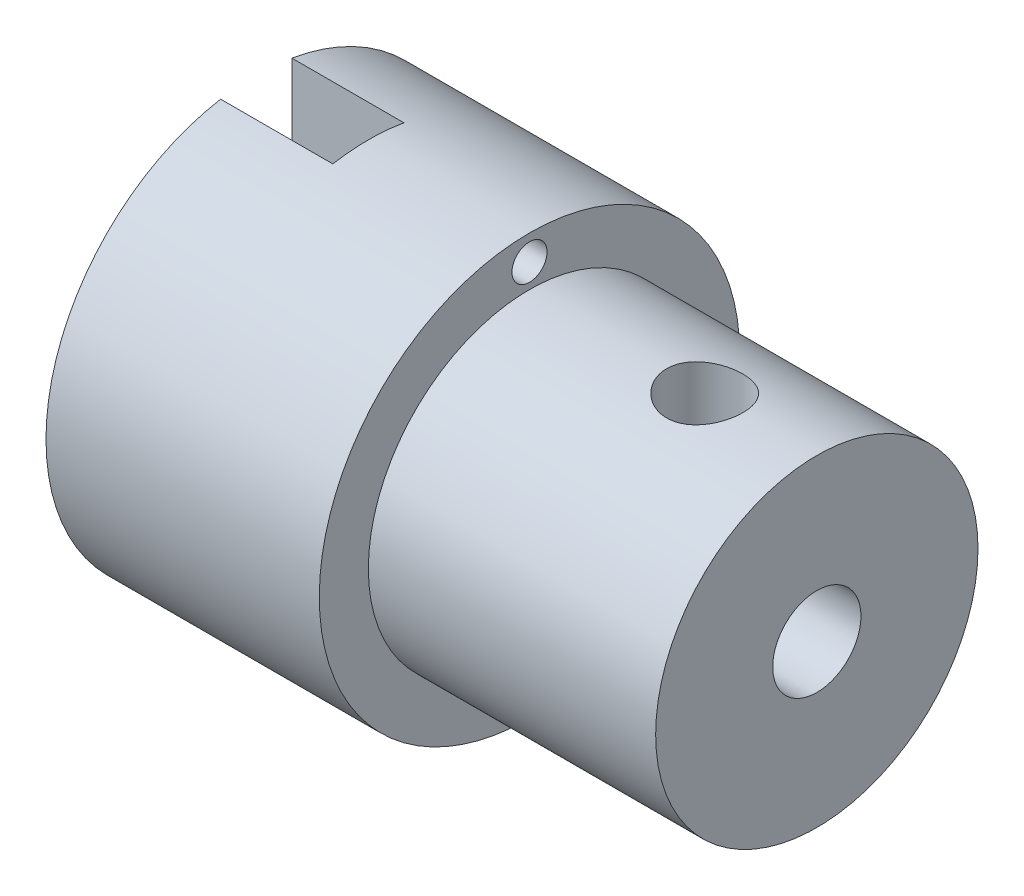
ISO-10303-21;
HEADER;
FILE_DESCRIPTION(('STEP AP214'),'2;1');
FILE_NAME('part.step','',(''),(''),'','','');
FILE_SCHEMA(('AUTOMOTIVE_DESIGN { 1 0 10303 214 1 1 1 1 }'));
ENDSEC;
DATA;
#1=APPLICATION_CONTEXT('core data for automotive mechanical design processes');
#2=APPLICATION_PROTOCOL_DEFINITION('international standard','automotive_design',2000,#1);
#3=PRODUCT_CONTEXT('',#1,'mechanical');
#4=PRODUCT('Part','Part','',(#3));
#5=PRODUCT_RELATED_PRODUCT_CATEGORY('part','',(#4));
#6=PRODUCT_DEFINITION_FORMATION('','',#4);
#7=PRODUCT_DEFINITION_CONTEXT('part definition',#1,'design');
#8=PRODUCT_DEFINITION('design','',#6,#7);
#9=PRODUCT_DEFINITION_SHAPE('','',#8);
#10=(LENGTH_UNIT() NAMED_UNIT(*) SI_UNIT(.MILLI.,.METRE.));
#11=(NAMED_UNIT(*) PLANE_ANGLE_UNIT() SI_UNIT($,.RADIAN.));
#12=(NAMED_UNIT(*) SI_UNIT($,.STERADIAN.) SOLID_ANGLE_UNIT());
#13=UNCERTAINTY_MEASURE_WITH_UNIT(LENGTH_MEASURE(1.E-05),#10,'distance_accuracy_value','');
#14=(GEOMETRIC_REPRESENTATION_CONTEXT(3) GLOBAL_UNCERTAINTY_ASSIGNED_CONTEXT((#13)) GLOBAL_UNIT_ASSIGNED_CONTEXT((#10,
#11,#12)) REPRESENTATION_CONTEXT('',''));
#15=CARTESIAN_POINT('',(0.,0.,0.));
#16=DIRECTION('',(0.,0.,1.));
#17=DIRECTION('',(1.,0.,0.));
#18=AXIS2_PLACEMENT_3D('',#15,#16,#17);
#19=CARTESIAN_POINT('',(25.4,0.,0.));
#20=DIRECTION('',(-1.,0.,0.));
#21=DIRECTION('',(0.,0.,1.));
#22=AXIS2_PLACEMENT_3D('',#19,#20,#21);
#23=CYLINDRICAL_SURFACE('',#22,1.5875);
#24=CARTESIAN_POINT('',(9.50799934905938,0.,0.));
#25=DIRECTION('',(-1.,0.,0.));
#26=DIRECTION('',(0.,0.,1.));
#27=AXIS2_PLACEMENT_3D('',#24,#25,#26);
#28=CIRCLE('',#27,1.5875);
#29=CARTESIAN_POINT('',(9.50799934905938,0.,1.5875));
#30=VERTEX_POINT('',#29);
#31=EDGE_CURVE('E137',#30,#30,#28,.F.);
#32=ORIENTED_EDGE('',*,*,#31,.F.);
#33=EDGE_LOOP('',(#32));
#34=FACE_BOUND('',#33,.T.);
#35=CARTESIAN_POINT('',(15.24,0.,0.));
#36=DIRECTION('',(1.,0.,0.));
#37=DIRECTION('',(0.,0.,-1.));
#38=AXIS2_PLACEMENT_3D('',#35,#36,#37);
#39=CIRCLE('',#38,1.5875);
#40=CARTESIAN_POINT('',(15.24,0.,-1.5875));
#41=VERTEX_POINT('',#40);
#42=EDGE_CURVE('E54',#41,#41,#39,.T.);
#43=ORIENTED_EDGE('',*,*,#42,.T.);
#44=EDGE_LOOP('',(#43));
#45=FACE_BOUND('',#44,.T.);
#46=ADVANCED_FACE('F50',(#34,#45),#23,.F.);
#47=CARTESIAN_POINT('',(5.08,-10.16,1.6129));
#48=DIRECTION('',(0.,0.,1.));
#49=DIRECTION('',(1.,0.,0.));
#50=AXIS2_PLACEMENT_3D('',#47,#48,#49);
#51=PLANE('',#50);
#52=DIRECTION('',(0.,1.,0.));
#53=VECTOR('',#52,1.);
#54=CARTESIAN_POINT('',(5.08,-10.16,1.6129));
#55=LINE('',#54,#53);
#56=CARTESIAN_POINT('',(5.08,3.62622808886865,1.6129));
#57=VERTEX_POINT('',#56);
#58=CARTESIAN_POINT('',(5.08,9.38744792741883,1.6129));
#59=VERTEX_POINT('',#58);
#60=EDGE_CURVE('E136',#57,#59,#55,.T.);
#61=ORIENTED_EDGE('',*,*,#60,.F.);
#62=DIRECTION('',(-1.,0.,0.));
#63=VECTOR('',#62,1.);
#64=CARTESIAN_POINT('',(0.,3.62622808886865,1.6129));
#65=LINE('',#64,#63);
#66=CARTESIAN_POINT('',(0.,3.62622808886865,1.6129));
#67=VERTEX_POINT('',#66);
#68=EDGE_CURVE('E120',#57,#67,#65,.T.);
#69=ORIENTED_EDGE('',*,*,#68,.T.);
#70=DIRECTION('',(0.,1.,0.));
#71=VECTOR('',#70,1.);
#72=CARTESIAN_POINT('',(0.,-10.16,1.6129));
#73=LINE('',#72,#71);
#74=CARTESIAN_POINT('',(0.,9.38744792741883,1.6129));
#75=VERTEX_POINT('',#74);
#76=EDGE_CURVE('E134',#67,#75,#73,.T.);
#77=ORIENTED_EDGE('',*,*,#76,.T.);
#78=DIRECTION('',(-1.,0.,0.));
#79=VECTOR('',#78,1.);
#80=CARTESIAN_POINT('',(25.4,9.38744792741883,1.61289999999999));
#81=LINE('',#80,#79);
#82=EDGE_CURVE('E170',#59,#75,#81,.T.);
#83=ORIENTED_EDGE('',*,*,#82,.F.);
#84=EDGE_LOOP('',(#61,#69,#77,#83));
#85=FACE_BOUND('',#84,.T.);
#86=ADVANCED_FACE('F132',(#85),#51,.F.);
#87=CARTESIAN_POINT('',(5.08,-10.16,-1.6129));
#88=DIRECTION('',(0.,0.,-1.));
#89=DIRECTION('',(-1.,0.,0.));
#90=AXIS2_PLACEMENT_3D('',#87,#88,#89);
#91=PLANE('',#90);
#92=DIRECTION('',(0.,1.,0.));
#93=VECTOR('',#92,1.);
#94=CARTESIAN_POINT('',(5.08,-10.16,-1.6129));
#95=LINE('',#94,#93);
#96=CARTESIAN_POINT('',(5.08,-9.38744792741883,-1.6129));
#97=VERTEX_POINT('',#96);
#98=CARTESIAN_POINT('',(5.08,-3.62622808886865,-1.6129));
#99=VERTEX_POINT('',#98);
#100=EDGE_CURVE('E153',#97,#99,#95,.T.);
#101=ORIENTED_EDGE('',*,*,#100,.T.);
#102=DIRECTION('',(-1.,0.,0.));
#103=VECTOR('',#102,1.);
#104=CARTESIAN_POINT('',(0.,-3.62622808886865,-1.6129));
#105=LINE('',#104,#103);
#106=CARTESIAN_POINT('',(0.,-3.62622808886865,-1.6129));
#107=VERTEX_POINT('',#106);
#108=EDGE_CURVE('E67',#99,#107,#105,.T.);
#109=ORIENTED_EDGE('',*,*,#108,.T.);
#110=DIRECTION('',(0.,1.,0.));
#111=VECTOR('',#110,1.);
#112=CARTESIAN_POINT('',(0.,-10.16,-1.6129));
#113=LINE('',#112,#111);
#114=CARTESIAN_POINT('',(0.,-9.38744792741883,-1.6129));
#115=VERTEX_POINT('',#114);
#116=EDGE_CURVE('E145',#115,#107,#113,.T.);
#117=ORIENTED_EDGE('',*,*,#116,.F.);
#118=DIRECTION('',(-1.,0.,0.));
#119=VECTOR('',#118,1.);
#120=CARTESIAN_POINT('',(25.4,-9.38744792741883,-1.6129));
#121=LINE('',#120,#119);
#122=EDGE_CURVE('E164',#97,#115,#121,.T.);
#123=ORIENTED_EDGE('',*,*,#122,.F.);
#124=EDGE_LOOP('',(#101,#109,#117,#123));
#125=FACE_BOUND('',#124,.T.);
#126=ADVANCED_FACE('F214',(#125),#91,.F.);
#127=CARTESIAN_POINT('',(5.08,-10.16,-1.6129));
#128=DIRECTION('',(1.,0.,0.));
#129=DIRECTION('',(0.,0.,-1.));
#130=AXIS2_PLACEMENT_3D('',#127,#128,#129);
#131=PLANE('',#130);
#132=CARTESIAN_POINT('',(5.08,3.62622808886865,-1.6129));
#133=VERTEX_POINT('',#132);
#134=CARTESIAN_POINT('',(5.08,9.38744792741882,-1.6129));
#135=VERTEX_POINT('',#134);
#136=EDGE_CURVE('E156',#133,#135,#95,.T.);
#137=ORIENTED_EDGE('',*,*,#136,.F.);
#138=CARTESIAN_POINT('',(5.08,0.,0.));
#139=DIRECTION('',(1.,0.,0.));
#140=DIRECTION('',(0.,0.,-1.));
#141=AXIS2_PLACEMENT_3D('',#138,#139,#140);
#142=CIRCLE('',#141,3.96875);
#143=EDGE_CURVE('E13',#133,#57,#142,.T.);
#144=ORIENTED_EDGE('',*,*,#143,.T.);
#145=ORIENTED_EDGE('',*,*,#60,.T.);
#146=CARTESIAN_POINT('',(5.08,0.,0.));
#147=DIRECTION('',(1.,0.,0.));
#148=DIRECTION('',(0.,0.,-1.));
#149=AXIS2_PLACEMENT_3D('',#146,#147,#148);
#150=CIRCLE('',#149,9.525);
#151=EDGE_CURVE('E160',#135,#59,#150,.T.);
#152=ORIENTED_EDGE('',*,*,#151,.F.);
#153=EDGE_LOOP('',(#137,#144,#145,#152));
#154=FACE_BOUND('',#153,.T.);
#155=ADVANCED_FACE('F236',(#154),#131,.F.);
#156=CARTESIAN_POINT('',(0.,0.,0.));
#157=DIRECTION('',(1.,0.,0.));
#158=DIRECTION('',(0.,0.,-1.));
#159=AXIS2_PLACEMENT_3D('',#156,#157,#158);
#160=PLANE('',#159);
#161=ORIENTED_EDGE('',*,*,#76,.F.);
#162=CARTESIAN_POINT('',(0.,0.,0.));
#163=DIRECTION('',(-1.,0.,0.));
#164=DIRECTION('',(0.,0.,1.));
#165=AXIS2_PLACEMENT_3D('',#162,#163,#164);
#166=CIRCLE('',#165,3.96875);
#167=CARTESIAN_POINT('',(0.,-3.62622808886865,1.6129));
#168=VERTEX_POINT('',#167);
#169=EDGE_CURVE('E117',#168,#67,#166,.T.);
#170=ORIENTED_EDGE('',*,*,#169,.F.);
#171=CARTESIAN_POINT('',(0.,-9.38744792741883,1.6129));
#172=VERTEX_POINT('',#171);
#173=EDGE_CURVE('E144',#172,#168,#73,.T.);
#174=ORIENTED_EDGE('',*,*,#173,.F.);
#175=CARTESIAN_POINT('',(0.,0.,0.));
#176=DIRECTION('',(1.,0.,0.));
#177=DIRECTION('',(0.,0.,-1.));
#178=AXIS2_PLACEMENT_3D('',#175,#176,#177);
#179=CIRCLE('',#178,9.525);
#180=EDGE_CURVE('E143',#75,#172,#179,.T.);
#181=ORIENTED_EDGE('',*,*,#180,.F.);
#182=EDGE_LOOP('',(#161,#170,#174,#181));
#183=FACE_BOUND('',#182,.T.);
#184=ADVANCED_FACE('F141',(#183),#160,.F.);
#185=CARTESIAN_POINT('',(25.4,0.,0.));
#186=DIRECTION('',(1.,0.,0.));
#187=DIRECTION('',(0.,0.,-1.));
#188=AXIS2_PLACEMENT_3D('',#185,#186,#187);
#189=PLANE('',#188);
#190=CARTESIAN_POINT('',(25.4,0.,0.));
#191=DIRECTION('',(1.,0.,0.));
#192=DIRECTION('',(0.,0.,-1.));
#193=AXIS2_PLACEMENT_3D('',#190,#191,#192);
#194=CIRCLE('',#193,2.00025);
#195=CARTESIAN_POINT('',(25.4,0.,-2.00025));
#196=VERTEX_POINT('',#195);
#197=EDGE_CURVE('E286',#196,#196,#194,.T.);
#198=ORIENTED_EDGE('',*,*,#197,.F.);
#199=EDGE_LOOP('',(#198));
#200=FACE_BOUND('',#199,.T.);
#201=CARTESIAN_POINT('',(25.4,0.,0.));
#202=DIRECTION('',(1.,0.,0.));
#203=DIRECTION('',(0.,0.,-1.));
#204=AXIS2_PLACEMENT_3D('',#201,#202,#203);
#205=CIRCLE('',#204,7.3025);
#206=CARTESIAN_POINT('',(25.4,0.,-7.3025));
#207=VERTEX_POINT('',#206);
#208=EDGE_CURVE('E172',#207,#207,#205,.T.);
#209=ORIENTED_EDGE('',*,*,#208,.T.);
#210=EDGE_LOOP('',(#209));
#211=FACE_BOUND('',#210,.T.);
#212=ADVANCED_FACE('F223',(#200,#211),#189,.T.);
#213=CARTESIAN_POINT('',(25.4,0.,0.));
#214=DIRECTION('',(-1.,0.,0.));
#215=DIRECTION('',(0.,0.,1.));
#216=AXIS2_PLACEMENT_3D('',#213,#214,#215);
#217=CYLINDRICAL_SURFACE('',#216,9.525);
#218=ORIENTED_EDGE('',*,*,#180,.T.);
#219=DIRECTION('',(-1.,0.,0.));
#220=VECTOR('',#219,1.);
#221=CARTESIAN_POINT('',(25.4,-9.38744792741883,1.6129));
#222=LINE('',#221,#220);
#223=CARTESIAN_POINT('',(5.08,-9.38744792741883,1.6129));
#224=VERTEX_POINT('',#223);
#225=EDGE_CURVE('E167',#172,#224,#222,.F.);
#226=ORIENTED_EDGE('',*,*,#225,.T.);
#227=EDGE_CURVE('E157',#224,#97,#150,.T.);
#228=ORIENTED_EDGE('',*,*,#227,.T.);
#229=ORIENTED_EDGE('',*,*,#122,.T.);
#230=CARTESIAN_POINT('',(0.,9.38744792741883,-1.6129));
#231=VERTEX_POINT('',#230);
#232=EDGE_CURVE('E179',#115,#231,#179,.T.);
#233=ORIENTED_EDGE('',*,*,#232,.T.);
#234=DIRECTION('',(-1.,0.,0.));
#235=VECTOR('',#234,1.);
#236=CARTESIAN_POINT('',(25.4,9.38744792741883,-1.61289999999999));
#237=LINE('',#236,#235);
#238=EDGE_CURVE('E161',#231,#135,#237,.F.);
#239=ORIENTED_EDGE('',*,*,#238,.T.);
#240=ORIENTED_EDGE('',*,*,#151,.T.);
#241=ORIENTED_EDGE('',*,*,#82,.T.);
#242=EDGE_LOOP('',(#218,#226,#228,#229,#233,#239,#240,#241));
#243=FACE_BOUND('',#242,.T.);
#244=CARTESIAN_POINT('',(12.3825,0.,0.));
#245=DIRECTION('',(1.,0.,0.));
#246=DIRECTION('',(0.,0.,-1.));
#247=AXIS2_PLACEMENT_3D('',#244,#245,#246);
#248=CIRCLE('',#247,9.525);
#249=CARTESIAN_POINT('',(12.3825,0.,-9.525));
#250=VERTEX_POINT('',#249);
#251=EDGE_CURVE('E178',#250,#250,#248,.T.);
#252=ORIENTED_EDGE('',*,*,#251,.F.);
#253=EDGE_LOOP('',(#252));
#254=FACE_BOUND('',#253,.T.);
#255=ADVANCED_FACE('F52',(#243,#254),#217,.T.);
#256=ORIENTED_EDGE('',*,*,#116,.T.);
#257=CARTESIAN_POINT('',(0.,3.62622808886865,-1.6129));
#258=VERTEX_POINT('',#257);
#259=EDGE_CURVE('E127',#258,#107,#166,.T.);
#260=ORIENTED_EDGE('',*,*,#259,.F.);
#261=EDGE_CURVE('E75',#258,#231,#113,.T.);
#262=ORIENTED_EDGE('',*,*,#261,.T.);
#263=ORIENTED_EDGE('',*,*,#232,.F.);
#264=EDGE_LOOP('',(#256,#260,#262,#263));
#265=FACE_BOUND('',#264,.T.);
#266=ADVANCED_FACE('F226',(#265),#160,.F.);
#267=CARTESIAN_POINT('',(12.3825,0.,0.));
#268=DIRECTION('',(1.,0.,0.));
#269=DIRECTION('',(0.,0.,-1.));
#270=AXIS2_PLACEMENT_3D('',#267,#268,#269);
#271=PLANE('',#270);
#272=CARTESIAN_POINT('',(12.3825,8.382,0.));
#273=DIRECTION('',(1.,0.,0.));
#274=DIRECTION('',(0.,0.,-1.));
#275=AXIS2_PLACEMENT_3D('',#272,#273,#274);
#276=CIRCLE('',#275,0.79375);
#277=CARTESIAN_POINT('',(12.3825,8.382,-0.79375));
#278=VERTEX_POINT('',#277);
#279=EDGE_CURVE('E185',#278,#278,#276,.T.);
#280=ORIENTED_EDGE('',*,*,#279,.F.);
#281=EDGE_LOOP('',(#280));
#282=FACE_BOUND('',#281,.T.);
#283=CARTESIAN_POINT('',(12.3825,0.,0.));
#284=DIRECTION('',(1.,0.,0.));
#285=DIRECTION('',(0.,0.,-1.));
#286=AXIS2_PLACEMENT_3D('',#283,#284,#285);
#287=CIRCLE('',#286,7.3025);
#288=CARTESIAN_POINT('',(12.3825,0.,-7.3025));
#289=VERTEX_POINT('',#288);
#290=EDGE_CURVE('E175',#289,#289,#287,.F.);
#291=ORIENTED_EDGE('',*,*,#290,.T.);
#292=EDGE_LOOP('',(#291));
#293=FACE_BOUND('',#292,.T.);
#294=ORIENTED_EDGE('',*,*,#251,.T.);
#295=EDGE_LOOP('',(#294));
#296=FACE_BOUND('',#295,.T.);
#297=ADVANCED_FACE('F228',(#282,#293,#296),#271,.T.);
#298=CARTESIAN_POINT('',(-27.2999786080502,0.,0.));
#299=DIRECTION('',(1.,0.,0.));
#300=DIRECTION('',(0.,0.,-1.));
#301=AXIS2_PLACEMENT_3D('',#298,#299,#300);
#302=CYLINDRICAL_SURFACE('',#301,7.3025);
#303=CARTESIAN_POINT('',(20.32,7.09530030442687,-1.72719999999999));
#304=CARTESIAN_POINT('',(20.2244498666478,7.09530220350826,-1.72719701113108));
#305=CARTESIAN_POINT('',(20.1288654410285,7.09725147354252,-1.71924413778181));
#306=CARTESIAN_POINT('',(19.9404295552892,7.10482055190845,-1.68768632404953));
#307=CARTESIAN_POINT('',(19.8475798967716,7.11044272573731,-1.66407129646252));
#308=CARTESIAN_POINT('',(19.667366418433,7.12468605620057,-1.60198650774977));
#309=CARTESIAN_POINT('',(19.5799961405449,7.13330360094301,-1.56353463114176));
#310=CARTESIAN_POINT('',(19.4129404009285,7.15256226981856,-1.47292075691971));
#311=CARTESIAN_POINT('',(19.3332550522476,7.16320342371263,-1.42075855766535));
#312=CARTESIAN_POINT('',(19.1822595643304,7.18554501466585,-1.30310708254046));
#313=CARTESIAN_POINT('',(19.1111231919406,7.19726090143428,-1.23739768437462));
#314=CARTESIAN_POINT('',(18.9807717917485,7.22029731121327,-1.09499168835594));
#315=CARTESIAN_POINT('',(18.921557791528,7.23161780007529,-1.01829414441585));
#316=CARTESIAN_POINT('',(18.8160315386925,7.2527576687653,-0.854909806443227));
#317=CARTESIAN_POINT('',(18.7698884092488,7.26255668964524,-0.768110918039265));
#318=CARTESIAN_POINT('',(18.6929109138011,7.27937405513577,-0.587719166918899));
#319=CARTESIAN_POINT('',(18.6620745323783,7.28639276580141,-0.494127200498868));
#320=CARTESIAN_POINT('',(18.6171379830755,7.29674949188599,-0.304615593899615));
#321=CARTESIAN_POINT('',(18.6027431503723,7.30015223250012,-0.208769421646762));
#322=CARTESIAN_POINT('',(18.5901750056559,7.30311859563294,-0.0159662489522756));
#323=CARTESIAN_POINT('',(18.5919995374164,7.30268272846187,0.0809906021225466));
#324=CARTESIAN_POINT('',(18.6116030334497,7.29806974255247,0.271224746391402));
#325=CARTESIAN_POINT('',(18.6290641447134,7.29396716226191,0.364536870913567));
#326=CARTESIAN_POINT('',(18.67893620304,7.28256765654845,0.546867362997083));
#327=CARTESIAN_POINT('',(18.7113478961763,7.27527057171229,0.635885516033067));
#328=CARTESIAN_POINT('',(18.7904688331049,7.25818531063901,0.807958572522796));
#329=CARTESIAN_POINT('',(18.8372944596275,7.2483769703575,0.890957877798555));
#330=CARTESIAN_POINT('',(18.9438264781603,7.2273383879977,1.04803409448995));
#331=CARTESIAN_POINT('',(19.0035348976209,7.21610792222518,1.12210959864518));
#332=CARTESIAN_POINT('',(19.1358536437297,7.1931322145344,1.2611291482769));
#333=CARTESIAN_POINT('',(19.208741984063,7.18138109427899,1.32580787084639));
#334=CARTESIAN_POINT('',(19.3644534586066,7.15894061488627,1.44207909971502));
#335=CARTESIAN_POINT('',(19.4472769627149,7.14825129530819,1.49367111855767));
#336=CARTESIAN_POINT('',(19.6209869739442,7.12912591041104,1.58245066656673));
#337=CARTESIAN_POINT('',(19.7119040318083,7.12069891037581,1.61958050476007));
#338=CARTESIAN_POINT('',(19.8989356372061,7.10717221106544,1.67795014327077));
#339=CARTESIAN_POINT('',(19.9950491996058,7.10207188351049,1.69919294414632));
#340=CARTESIAN_POINT('',(20.1873010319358,7.09590626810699,1.72475819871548));
#341=CARTESIAN_POINT('',(20.2833845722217,7.09474808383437,1.72947028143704));
#342=CARTESIAN_POINT('',(20.4749645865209,7.0963460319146,1.72290177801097));
#343=CARTESIAN_POINT('',(20.570461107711,7.09910184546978,1.71162249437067));
#344=CARTESIAN_POINT('',(20.7567501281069,7.10812882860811,1.67373152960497));
#345=CARTESIAN_POINT('',(20.8475903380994,7.11434921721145,1.64734118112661));
#346=CARTESIAN_POINT('',(21.0235587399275,7.12955732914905,1.58022002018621));
#347=CARTESIAN_POINT('',(21.1086863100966,7.13854535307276,1.53948764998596));
#348=CARTESIAN_POINT('',(21.272479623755,7.15847538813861,1.44400415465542));
#349=CARTESIAN_POINT('',(21.3510037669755,7.16944926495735,1.38901692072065));
#350=CARTESIAN_POINT('',(21.4978533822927,7.19203379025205,1.2668877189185));
#351=CARTESIAN_POINT('',(21.5661773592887,7.20364453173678,1.19974397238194));
#352=CARTESIAN_POINT('',(21.6922359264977,7.22650555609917,1.05343058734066));
#353=CARTESIAN_POINT('',(21.7497026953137,7.23774217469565,0.974027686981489));
#354=CARTESIAN_POINT('',(21.8504839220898,7.25832109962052,0.806470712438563));
#355=CARTESIAN_POINT('',(21.893799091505,7.26766350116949,0.718317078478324));
#356=CARTESIAN_POINT('',(21.9646929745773,7.28334460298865,0.536349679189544));
#357=CARTESIAN_POINT('',(21.9923797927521,7.289703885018,0.442579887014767));
#358=CARTESIAN_POINT('',(22.0315621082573,7.29879187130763,0.251550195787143));
#359=CARTESIAN_POINT('',(22.0430603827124,7.30152119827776,0.154290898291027));
#360=CARTESIAN_POINT('',(22.0493968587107,7.30301941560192,-0.038429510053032));
#361=CARTESIAN_POINT('',(22.0446322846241,7.30188273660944,-0.13387703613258));
#362=CARTESIAN_POINT('',(22.0194786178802,7.29598289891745,-0.322569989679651));
#363=CARTESIAN_POINT('',(21.999089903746,7.29121982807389,-0.415815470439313));
#364=CARTESIAN_POINT('',(21.94347008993,7.27861366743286,-0.597089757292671));
#365=CARTESIAN_POINT('',(21.9083039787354,7.27078407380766,-0.685139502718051));
#366=CARTESIAN_POINT('',(21.8241879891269,7.252874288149,-0.854137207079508));
#367=CARTESIAN_POINT('',(21.7752365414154,7.24279383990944,-0.935084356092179));
#368=CARTESIAN_POINT('',(21.6636905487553,7.22120067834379,-1.08948738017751));
#369=CARTESIAN_POINT('',(21.6008219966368,7.20966154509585,-1.16274161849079));
#370=CARTESIAN_POINT('',(21.4637677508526,7.18658036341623,-1.29779570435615));
#371=CARTESIAN_POINT('',(21.3895792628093,7.1750383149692,-1.3595927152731));
#372=CARTESIAN_POINT('',(21.2305420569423,7.15304685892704,-1.47095517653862));
#373=CARTESIAN_POINT('',(21.1455398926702,7.14261822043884,-1.52030587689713));
#374=CARTESIAN_POINT('',(20.968214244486,7.12430495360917,-1.60394253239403));
#375=CARTESIAN_POINT('',(20.8758965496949,7.11641833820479,-1.63824026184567));
#376=CARTESIAN_POINT('',(20.706349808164,7.105416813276,-1.68523160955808));
#377=CARTESIAN_POINT('',(20.6299837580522,7.10165012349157,-1.70093734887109));
#378=CARTESIAN_POINT('',(20.4757526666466,7.09659117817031,-1.72192241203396));
#379=CARTESIAN_POINT('',(20.3978877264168,7.09529875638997,-1.72720243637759));
#380=CARTESIAN_POINT('',(20.32,7.09530030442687,-1.72719999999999));
#381=B_SPLINE_CURVE_WITH_KNOTS('',3,(#303,#304,#305,#306,#307,#308,#309,#310,#311,#312,#313,
#314,#315,#316,#317,#318,#319,#320,#321,#322,#323,#324,#325,#326,#327,#328,#329,#330,#331,#332,
#333,#334,#335,#336,#337,#338,#339,#340,#341,#342,#343,#344,#345,#346,#347,#348,#349,#350,#351,
#352,#353,#354,#355,#356,#357,#358,#359,#360,#361,#362,#363,#364,#365,#366,#367,#368,#369,#370,
#371,#372,#373,#374,#375,#376,#377,#378,#379,#380),.UNSPECIFIED.,.T.,.F.,(4,2,2,2,2,2,2,2,2,2,2,
2,2,2,2,2,2,2,2,2,2,2,2,2,2,2,2,2,2,2,2,2,2,2,2,2,2,2,4),(0.,0.286364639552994,
0.572913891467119,0.859118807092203,1.14532793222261,1.43661729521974,1.72793175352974,
2.02285925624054,2.31774791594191,2.60726431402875,2.89674222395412,3.18046607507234,
3.46420408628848,3.75029600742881,4.03643298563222,4.32951607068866,4.62261007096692,
4.91686156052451,5.21105746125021,5.49827077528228,5.78546069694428,6.06854796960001,
6.35166599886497,6.63981183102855,6.92799985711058,7.22256585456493,7.51711704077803,
7.80960497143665,8.10204272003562,8.38738922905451,8.67272882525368,8.95682646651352,
9.24095646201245,9.53127682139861,9.82166896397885,10.1167732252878,10.4116462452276,
10.645092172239,10.8785224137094),.UNSPECIFIED.);
#382=CARTESIAN_POINT('',(20.32,7.09530030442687,-1.72719999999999));
#383=VERTEX_POINT('',#382);
#384=EDGE_CURVE('E128',#383,#383,#381,.T.);
#385=ORIENTED_EDGE('',*,*,#384,.F.);
#386=EDGE_LOOP('',(#385));
#387=FACE_BOUND('',#386,.T.);
#388=ORIENTED_EDGE('',*,*,#290,.F.);
#389=EDGE_LOOP('',(#388));
#390=FACE_BOUND('',#389,.T.);
#391=ORIENTED_EDGE('',*,*,#208,.F.);
#392=EDGE_LOOP('',(#391));
#393=FACE_BOUND('',#392,.T.);
#394=ADVANCED_FACE('F221',(#387,#390,#393),#302,.T.);
#395=ORIENTED_EDGE('',*,*,#173,.T.);
#396=DIRECTION('',(-1.,0.,0.));
#397=VECTOR('',#396,1.);
#398=CARTESIAN_POINT('',(0.,-3.62622808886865,1.6129));
#399=LINE('',#398,#397);
#400=CARTESIAN_POINT('',(5.08,-3.62622808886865,1.6129));
#401=VERTEX_POINT('',#400);
#402=EDGE_CURVE('E122',#168,#401,#399,.F.);
#403=ORIENTED_EDGE('',*,*,#402,.T.);
#404=EDGE_CURVE('E150',#224,#401,#55,.T.);
#405=ORIENTED_EDGE('',*,*,#404,.F.);
#406=ORIENTED_EDGE('',*,*,#225,.F.);
#407=EDGE_LOOP('',(#395,#403,#405,#406));
#408=FACE_BOUND('',#407,.T.);
#409=ADVANCED_FACE('F216',(#408),#51,.F.);
#410=ORIENTED_EDGE('',*,*,#261,.F.);
#411=DIRECTION('',(-1.,0.,0.));
#412=VECTOR('',#411,1.);
#413=CARTESIAN_POINT('',(0.,3.62622808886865,-1.6129));
#414=LINE('',#413,#412);
#415=EDGE_CURVE('E138',#258,#133,#414,.F.);
#416=ORIENTED_EDGE('',*,*,#415,.T.);
#417=ORIENTED_EDGE('',*,*,#136,.T.);
#418=ORIENTED_EDGE('',*,*,#238,.F.);
#419=EDGE_LOOP('',(#410,#416,#417,#418));
#420=FACE_BOUND('',#419,.T.);
#421=ADVANCED_FACE('F248',(#420),#91,.F.);
#422=ORIENTED_EDGE('',*,*,#404,.T.);
#423=EDGE_CURVE('E59',#401,#99,#142,.T.);
#424=ORIENTED_EDGE('',*,*,#423,.T.);
#425=ORIENTED_EDGE('',*,*,#100,.F.);
#426=ORIENTED_EDGE('',*,*,#227,.F.);
#427=EDGE_LOOP('',(#422,#424,#425,#426));
#428=FACE_BOUND('',#427,.T.);
#429=ADVANCED_FACE('F242',(#428),#131,.F.);
#430=CARTESIAN_POINT('',(6.0325,8.382,0.));
#431=DIRECTION('',(1.,0.,0.));
#432=DIRECTION('',(0.,0.,-1.));
#433=AXIS2_PLACEMENT_3D('',#430,#431,#432);
#434=CYLINDRICAL_SURFACE('',#433,0.79375);
#435=CARTESIAN_POINT('',(6.0325,8.382,0.));
#436=DIRECTION('',(1.,0.,0.));
#437=DIRECTION('',(0.,0.,-1.));
#438=AXIS2_PLACEMENT_3D('',#435,#436,#437);
#439=CIRCLE('',#438,0.79375);
#440=CARTESIAN_POINT('',(6.0325,8.382,-0.79375));
#441=VERTEX_POINT('',#440);
#442=EDGE_CURVE('E269',#441,#441,#439,.T.);
#443=ORIENTED_EDGE('',*,*,#442,.F.);
#444=EDGE_LOOP('',(#443));
#445=FACE_BOUND('',#444,.T.);
#446=ORIENTED_EDGE('',*,*,#279,.T.);
#447=EDGE_LOOP('',(#446));
#448=FACE_BOUND('',#447,.T.);
#449=ADVANCED_FACE('F251',(#445,#448),#434,.F.);
#450=CARTESIAN_POINT('',(6.0325,8.382,0.));
#451=DIRECTION('',(1.,0.,0.));
#452=DIRECTION('',(0.,0.,-1.));
#453=AXIS2_PLACEMENT_3D('',#450,#451,#452);
#454=PLANE('',#453);
#455=ORIENTED_EDGE('',*,*,#442,.T.);
#456=EDGE_LOOP('',(#455));
#457=FACE_BOUND('',#456,.T.);
#458=ADVANCED_FACE('F257',(#457),#454,.T.);
#459=CARTESIAN_POINT('',(0.,0.,0.));
#460=DIRECTION('',(-1.,0.,0.));
#461=DIRECTION('',(0.,0.,1.));
#462=AXIS2_PLACEMENT_3D('',#459,#460,#461);
#463=CYLINDRICAL_SURFACE('',#462,3.96875);
#464=CARTESIAN_POINT('',(8.0772,0.,0.));
#465=DIRECTION('',(-1.,0.,0.));
#466=DIRECTION('',(0.,0.,1.));
#467=AXIS2_PLACEMENT_3D('',#464,#465,#466);
#468=CIRCLE('',#467,3.96875);
#469=CARTESIAN_POINT('',(8.0772,0.,3.96875));
#470=VERTEX_POINT('',#469);
#471=EDGE_CURVE('E279',#470,#470,#468,.T.);
#472=ORIENTED_EDGE('',*,*,#471,.F.);
#473=EDGE_LOOP('',(#472));
#474=FACE_BOUND('',#473,.T.);
#475=ORIENTED_EDGE('',*,*,#143,.F.);
#476=ORIENTED_EDGE('',*,*,#415,.F.);
#477=ORIENTED_EDGE('',*,*,#259,.T.);
#478=ORIENTED_EDGE('',*,*,#108,.F.);
#479=ORIENTED_EDGE('',*,*,#423,.F.);
#480=ORIENTED_EDGE('',*,*,#402,.F.);
#481=ORIENTED_EDGE('',*,*,#169,.T.);
#482=ORIENTED_EDGE('',*,*,#68,.F.);
#483=EDGE_LOOP('',(#475,#476,#477,#478,#479,#480,#481,#482));
#484=FACE_BOUND('',#483,.T.);
#485=ADVANCED_FACE('F119',(#474,#484),#463,.F.);
#486=CARTESIAN_POINT('',(8.0772,0.,0.));
#487=DIRECTION('',(-1.,0.,0.));
#488=DIRECTION('',(0.,0.,1.));
#489=AXIS2_PLACEMENT_3D('',#486,#487,#488);
#490=CONICAL_SURFACE('',#489,3.96875,1.02974425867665);
#491=ORIENTED_EDGE('',*,*,#31,.T.);
#492=EDGE_LOOP('',(#491));
#493=FACE_BOUND('',#492,.T.);
#494=ORIENTED_EDGE('',*,*,#471,.T.);
#495=EDGE_LOOP('',(#494));
#496=FACE_BOUND('',#495,.T.);
#497=ADVANCED_FACE('F292',(#493,#496),#490,.F.);
#498=CARTESIAN_POINT('',(20.32,0.,0.));
#499=DIRECTION('',(0.,-1.,0.));
#500=DIRECTION('',(0.,0.,-1.));
#501=AXIS2_PLACEMENT_3D('',#498,#499,#500);
#502=CYLINDRICAL_SURFACE('',#501,1.72719999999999);
#503=CARTESIAN_POINT('',(20.32,1.00885094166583,-1.72719999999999));
#504=CARTESIAN_POINT('',(20.377164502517,1.00886653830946,-1.72719462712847));
#505=CARTESIAN_POINT('',(20.4343834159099,1.01382084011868,-1.72432549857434));
#506=CARTESIAN_POINT('',(20.5468503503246,1.03253229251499,-1.71317926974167));
#507=CARTESIAN_POINT('',(20.602092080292,1.04631528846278,-1.70488629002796));
#508=CARTESIAN_POINT('',(20.7325243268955,1.08748921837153,-1.67903773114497));
#509=CARTESIAN_POINT('',(20.8061473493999,1.11817860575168,-1.65903799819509));
#510=CARTESIAN_POINT('',(20.9474006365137,1.18640592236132,-1.6109605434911));
#511=CARTESIAN_POINT('',(21.0150071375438,1.22396936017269,-1.58285250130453));
#512=CARTESIAN_POINT('',(21.1300055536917,1.29317818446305,-1.52650340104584));
#513=CARTESIAN_POINT('',(21.1784984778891,1.32422710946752,-1.49974583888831));
#514=CARTESIAN_POINT('',(21.2724203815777,1.38696229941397,-1.44192923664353));
#515=CARTESIAN_POINT('',(21.317847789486,1.41864888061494,-1.41086801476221));
#516=CARTESIAN_POINT('',(21.4494891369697,1.51319666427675,-1.31132567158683));
#517=CARTESIAN_POINT('',(21.5312814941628,1.57568688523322,-1.23637784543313));
#518=CARTESIAN_POINT('',(21.6641867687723,1.68029278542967,-1.08808133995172));
#519=CARTESIAN_POINT('',(21.7180585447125,1.72382503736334,-1.0181841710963));
#520=CARTESIAN_POINT('',(21.8158117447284,1.80400803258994,-0.868186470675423));
#521=CARTESIAN_POINT('',(21.8597098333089,1.84067023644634,-0.788103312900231));
#522=CARTESIAN_POINT('',(21.9283019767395,1.89845842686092,-0.634285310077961));
#523=CARTESIAN_POINT('',(21.9550408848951,1.92120017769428,-0.562075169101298));
#524=CARTESIAN_POINT('',(21.9989442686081,1.95869911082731,-0.412800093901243));
#525=CARTESIAN_POINT('',(22.0161144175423,1.97346102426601,-0.335738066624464));
#526=CARTESIAN_POINT('',(22.0398126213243,1.99386533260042,-0.178384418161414));
#527=CARTESIAN_POINT('',(22.0462880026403,1.99946258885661,-0.0980787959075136));
#528=CARTESIAN_POINT('',(22.0479311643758,2.0008812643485,0.0627332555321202));
#529=CARTESIAN_POINT('',(22.0431004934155,1.99670402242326,0.143239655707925));
#530=CARTESIAN_POINT('',(22.0233439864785,1.97968155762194,0.295390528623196));
#531=CARTESIAN_POINT('',(22.0092552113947,1.96755524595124,0.367229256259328));
#532=CARTESIAN_POINT('',(21.9726670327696,1.9362333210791,0.507090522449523));
#533=CARTESIAN_POINT('',(21.9501662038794,1.9170365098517,0.575112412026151));
#534=CARTESIAN_POINT('',(21.8958953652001,1.8710963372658,0.710996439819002));
#535=CARTESIAN_POINT('',(21.8635657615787,1.84390211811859,0.778479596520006));
#536=CARTESIAN_POINT('',(21.7917559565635,1.7842221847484,0.90696227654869));
#537=CARTESIAN_POINT('',(21.7522709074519,1.75173288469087,0.967957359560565));
#538=CARTESIAN_POINT('',(21.6456218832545,1.66541806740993,1.11248440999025));
#539=CARTESIAN_POINT('',(21.5745910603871,1.60914217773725,1.19171061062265));
#540=CARTESIAN_POINT('',(21.421096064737,1.4925319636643,1.33487162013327));
#541=CARTESIAN_POINT('',(21.3386029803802,1.43218758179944,1.39876661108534));
#542=CARTESIAN_POINT('',(21.1792314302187,1.32412122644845,1.50071518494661));
#543=CARTESIAN_POINT('',(21.1041701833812,1.27614214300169,1.54136538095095));
#544=CARTESIAN_POINT('',(20.9461922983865,1.18561402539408,1.61200695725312));
#545=CARTESIAN_POINT('',(20.8633018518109,1.14304793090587,1.6420323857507));
#546=CARTESIAN_POINT('',(20.7256005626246,1.08637983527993,1.6797076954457));
#547=CARTESIAN_POINT('',(20.6737694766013,1.06785849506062,1.69144813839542));
#548=CARTESIAN_POINT('',(20.567407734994,1.03750011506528,1.71023752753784));
#549=CARTESIAN_POINT('',(20.5128844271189,1.0256458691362,1.71729855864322));
#550=CARTESIAN_POINT('',(20.4015240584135,1.01063041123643,1.7261850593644));
#551=CARTESIAN_POINT('',(20.3446679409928,1.00756790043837,1.72795109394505));
#552=CARTESIAN_POINT('',(20.2313571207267,1.01114794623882,1.72585645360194));
#553=CARTESIAN_POINT('',(20.1749027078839,1.01779691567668,1.72199206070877));
#554=CARTESIAN_POINT('',(20.0553704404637,1.04106538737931,1.70803524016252));
#555=CARTESIAN_POINT('',(19.9926943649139,1.05912104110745,1.69703820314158));
#556=CARTESIAN_POINT('',(19.871308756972,1.10265873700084,1.66907355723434));
#557=CARTESIAN_POINT('',(19.8126146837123,1.12816788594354,1.6520841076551));
#558=CARTESIAN_POINT('',(19.7077176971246,1.17936735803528,1.6158365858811));
#559=CARTESIAN_POINT('',(19.6609603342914,1.20445868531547,1.5972990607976));
#560=CARTESIAN_POINT('',(19.5700689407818,1.25650035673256,1.5566953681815));
#561=CARTESIAN_POINT('',(19.5259367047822,1.28345194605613,1.53462682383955));
#562=CARTESIAN_POINT('',(19.3971184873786,1.36567587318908,1.46327510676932));
#563=CARTESIAN_POINT('',(19.3160670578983,1.42228730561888,1.40886574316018));
#564=CARTESIAN_POINT('',(19.1590096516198,1.53710628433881,1.2829772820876));
#565=CARTESIAN_POINT('',(19.0835848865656,1.59521045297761,1.2106794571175));
#566=CARTESIAN_POINT('',(18.9451853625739,1.70473524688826,1.05081536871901));
#567=CARTESIAN_POINT('',(18.8821777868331,1.75617336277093,0.963290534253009));
#568=CARTESIAN_POINT('',(18.787814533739,1.83436674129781,0.801063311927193));
#569=CARTESIAN_POINT('',(18.7525766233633,1.8639563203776,0.729986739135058));
#570=CARTESIAN_POINT('',(18.69156685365,1.91554362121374,0.581264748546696));
#571=CARTESIAN_POINT('',(18.6657887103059,1.93754638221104,0.503623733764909));
#572=CARTESIAN_POINT('',(18.6251281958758,1.97237413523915,0.342852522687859));
#573=CARTESIAN_POINT('',(18.6103289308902,1.98512910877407,0.259685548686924));
#574=CARTESIAN_POINT('',(18.5931325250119,1.99995784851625,0.0911452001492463));
#575=CARTESIAN_POINT('',(18.5907276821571,2.00203824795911,0.00577322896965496));
#576=CARTESIAN_POINT('',(18.5980425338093,1.99572455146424,-0.154049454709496));
#577=CARTESIAN_POINT('',(18.6063871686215,1.98851834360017,-0.22861751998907));
#578=CARTESIAN_POINT('',(18.6323384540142,1.96619887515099,-0.374882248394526));
#579=CARTESIAN_POINT('',(18.6499463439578,1.95108455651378,-0.44657852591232));
#580=CARTESIAN_POINT('',(18.6938106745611,1.91367140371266,-0.586699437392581));
#581=CARTESIAN_POINT('',(18.7202114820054,1.8912527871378,-0.655046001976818));
#582=CARTESIAN_POINT('',(18.780361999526,1.84065285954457,-0.786092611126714));
#583=CARTESIAN_POINT('',(18.8141145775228,1.81246929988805,-0.84879043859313));
#584=CARTESIAN_POINT('',(18.9052735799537,1.73731779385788,-0.996202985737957));
#585=CARTESIAN_POINT('',(18.9663275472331,1.68776011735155,-1.0773527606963));
#586=CARTESIAN_POINT('',(19.0993818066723,1.58303385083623,-1.22610275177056));
#587=CARTESIAN_POINT('',(19.1714148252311,1.52784865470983,-1.29366100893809));
#588=CARTESIAN_POINT('',(19.326649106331,1.41477046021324,-1.41650388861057));
#589=CARTESIAN_POINT('',(19.4100468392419,1.35684526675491,-1.47151253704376));
#590=CARTESIAN_POINT('',(19.5427341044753,1.27309651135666,-1.54323981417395));
#591=CARTESIAN_POINT('',(19.5882005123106,1.24571799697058,-1.5653418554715));
#592=CARTESIAN_POINT('',(19.6819099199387,1.19307644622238,-1.60582227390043));
#593=CARTESIAN_POINT('',(19.7301504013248,1.16781154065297,-1.62420396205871));
#594=CARTESIAN_POINT('',(19.8332079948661,1.11916627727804,-1.658133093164));
#595=CARTESIAN_POINT('',(19.8882488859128,1.0960467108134,-1.67338701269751));
#596=CARTESIAN_POINT('',(20.0017717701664,1.05653073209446,-1.69861692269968));
#597=CARTESIAN_POINT('',(20.0602398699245,1.04010906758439,-1.70861277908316));
#598=CARTESIAN_POINT('',(20.1527778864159,1.02210842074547,-1.71940376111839));
#599=CARTESIAN_POINT('',(20.1859565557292,1.0171755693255,-1.72231526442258));
#600=CARTESIAN_POINT('',(20.2527505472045,1.01054229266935,-1.72621493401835));
#601=CARTESIAN_POINT('',(20.2863658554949,1.00884176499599,-1.72720316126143));
#602=CARTESIAN_POINT('',(20.32,1.00885094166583,-1.72719999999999));
#603=B_SPLINE_CURVE_WITH_KNOTS('',3,(#503,#504,#505,#506,#507,#508,#509,#510,#511,#512,#513,
#514,#515,#516,#517,#518,#519,#520,#521,#522,#523,#524,#525,#526,#527,#528,#529,#530,#531,#532,
#533,#534,#535,#536,#537,#538,#539,#540,#541,#542,#543,#544,#545,#546,#547,#548,#549,#550,#551,
#552,#553,#554,#555,#556,#557,#558,#559,#560,#561,#562,#563,#564,#565,#566,#567,#568,#569,#570,
#571,#572,#573,#574,#575,#576,#577,#578,#579,#580,#581,#582,#583,#584,#585,#586,#587,#588,#589,
#590,#591,#592,#593,#594,#595,#596,#597,#598,#599,#600,#601,#602),.UNSPECIFIED.,.T.,.F.,(4,2,2,
2,2,2,2,2,2,2,2,2,2,2,2,2,2,2,2,2,2,2,2,2,2,2,2,2,2,2,2,2,2,2,2,2,2,2,2,2,2,2,2,2,2,2,2,2,2,4),
(0.,0.171341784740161,0.343187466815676,0.588496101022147,0.834734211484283,1.02498235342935,
1.2153272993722,1.59518016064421,1.88936437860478,2.18305338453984,2.42293926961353,
2.66268277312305,2.90360357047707,3.14449137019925,3.3661406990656,3.58782760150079,
3.8258034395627,4.06394110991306,4.42313642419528,4.78325477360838,5.07628195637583,
5.36836141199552,5.53671138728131,5.70462487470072,5.87441622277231,6.04431974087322,
6.24164813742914,6.43970330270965,6.6081042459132,6.77661902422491,7.11384637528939,
7.47100220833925,7.82720108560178,8.08025747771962,8.33314546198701,8.58792871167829,
8.84255361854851,9.06762061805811,9.292717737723,9.52170950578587,9.75079076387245,
10.0879295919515,10.4260937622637,10.7710996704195,10.943408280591,11.1155628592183,
11.2999287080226,11.4835928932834,11.5844092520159,11.6852224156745),.UNSPECIFIED.);
#604=CARTESIAN_POINT('',(20.32,1.00885094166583,-1.72719999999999));
#605=VERTEX_POINT('',#604);
#606=EDGE_CURVE('E186',#605,#605,#603,.T.);
#607=ORIENTED_EDGE('',*,*,#606,.T.);
#608=EDGE_LOOP('',(#607));
#609=FACE_BOUND('',#608,.T.);
#610=ORIENTED_EDGE('',*,*,#384,.T.);
#611=EDGE_LOOP('',(#610));
#612=FACE_BOUND('',#611,.T.);
#613=ADVANCED_FACE('F193',(#609,#612),#502,.F.);
#614=CARTESIAN_POINT('',(15.24,0.,0.));
#615=DIRECTION('',(1.,0.,0.));
#616=DIRECTION('',(0.,0.,-1.));
#617=AXIS2_PLACEMENT_3D('',#614,#615,#616);
#618=CYLINDRICAL_SURFACE('',#617,2.00025);
#619=ORIENTED_EDGE('',*,*,#197,.T.);
#620=EDGE_LOOP('',(#619));
#621=FACE_BOUND('',#620,.T.);
#622=CARTESIAN_POINT('',(15.24,0.,0.));
#623=DIRECTION('',(1.,0.,0.));
#624=DIRECTION('',(0.,0.,-1.));
#625=AXIS2_PLACEMENT_3D('',#622,#623,#624);
#626=CIRCLE('',#625,2.00025);
#627=CARTESIAN_POINT('',(15.24,0.,-2.00025));
#628=VERTEX_POINT('',#627);
#629=EDGE_CURVE('E192',#628,#628,#626,.T.);
#630=ORIENTED_EDGE('',*,*,#629,.F.);
#631=EDGE_LOOP('',(#630));
#632=FACE_BOUND('',#631,.T.);
#633=ORIENTED_EDGE('',*,*,#606,.F.);
#634=EDGE_LOOP('',(#633));
#635=FACE_BOUND('',#634,.T.);
#636=ADVANCED_FACE('F196',(#621,#632,#635),#618,.F.);
#637=CARTESIAN_POINT('',(15.24,0.,0.));
#638=DIRECTION('',(1.,0.,0.));
#639=DIRECTION('',(0.,0.,-1.));
#640=AXIS2_PLACEMENT_3D('',#637,#638,#639);
#641=PLANE('',#640);
#642=ORIENTED_EDGE('',*,*,#42,.F.);
#643=EDGE_LOOP('',(#642));
#644=FACE_BOUND('',#643,.T.);
#645=ORIENTED_EDGE('',*,*,#629,.T.);
#646=EDGE_LOOP('',(#645));
#647=FACE_BOUND('',#646,.T.);
#648=ADVANCED_FACE('F200',(#644,#647),#641,.T.);
#649=CLOSED_SHELL('',(#46,#86,#126,#155,#184,#212,#255,#266,#297,#394,#409,#421,#429,#449,#458,
#485,#497,#613,#636,#648));
#650=MANIFOLD_SOLID_BREP('B2',#649);
#651=ADVANCED_BREP_SHAPE_REPRESENTATION('',(#18,#650),#14);
#652=SHAPE_DEFINITION_REPRESENTATION(#9,#651);
ENDSEC;
END-ISO-10303-21;
